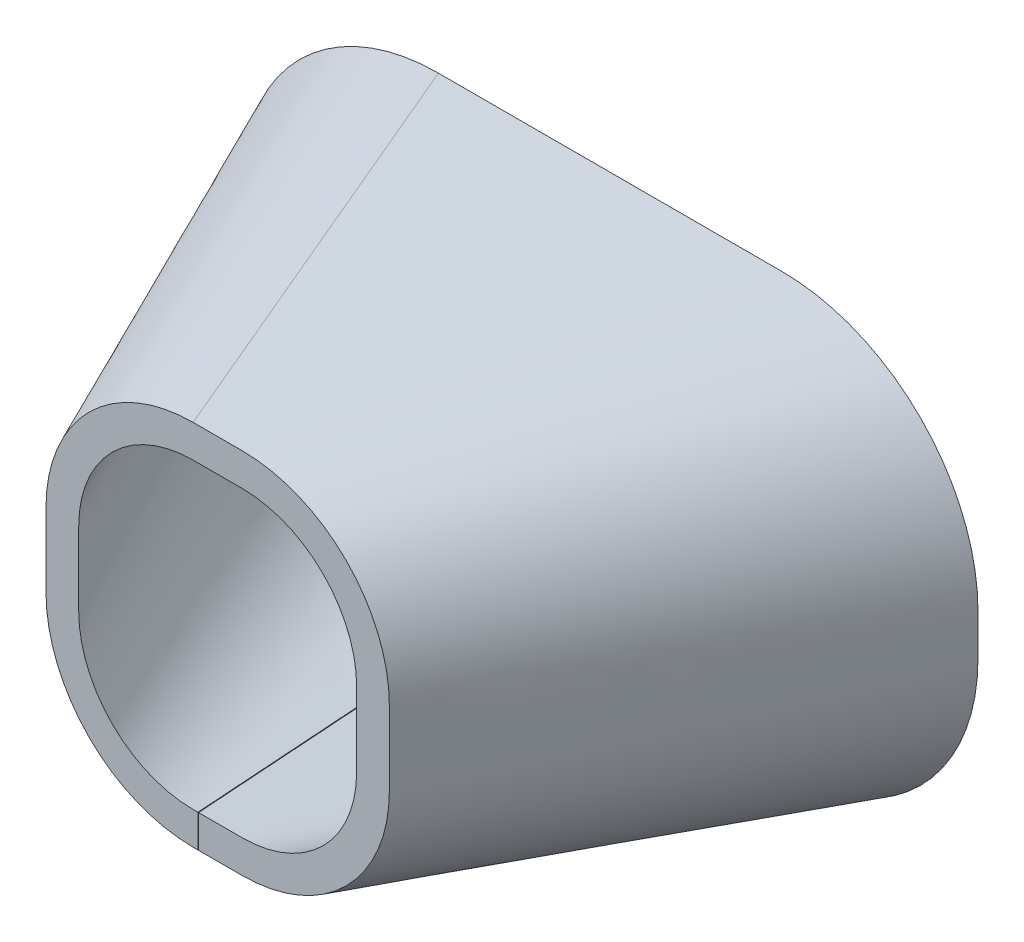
ISO-10303-21;
HEADER;
FILE_DESCRIPTION(('STEP AP214'),'2;1');
FILE_NAME('part.step','',(''),(''),'','','');
FILE_SCHEMA(('AUTOMOTIVE_DESIGN { 1 0 10303 214 1 1 1 1 }'));
ENDSEC;
DATA;
#1=APPLICATION_CONTEXT('core data for automotive mechanical design processes');
#2=APPLICATION_PROTOCOL_DEFINITION('international standard','automotive_design',2000,#1);
#3=PRODUCT_CONTEXT('',#1,'mechanical');
#4=PRODUCT('Part','Part','',(#3));
#5=PRODUCT_RELATED_PRODUCT_CATEGORY('part','',(#4));
#6=PRODUCT_DEFINITION_FORMATION('','',#4);
#7=PRODUCT_DEFINITION_CONTEXT('part definition',#1,'design');
#8=PRODUCT_DEFINITION('design','',#6,#7);
#9=PRODUCT_DEFINITION_SHAPE('','',#8);
#10=(LENGTH_UNIT() NAMED_UNIT(*) SI_UNIT(.MILLI.,.METRE.));
#11=(NAMED_UNIT(*) PLANE_ANGLE_UNIT() SI_UNIT($,.RADIAN.));
#12=(NAMED_UNIT(*) SI_UNIT($,.STERADIAN.) SOLID_ANGLE_UNIT());
#13=UNCERTAINTY_MEASURE_WITH_UNIT(LENGTH_MEASURE(1.E-05),#10,'distance_accuracy_value','');
#14=(GEOMETRIC_REPRESENTATION_CONTEXT(3) GLOBAL_UNCERTAINTY_ASSIGNED_CONTEXT((#13)) GLOBAL_UNIT_ASSIGNED_CONTEXT((#10,
#11,#12)) REPRESENTATION_CONTEXT('',''));
#15=CARTESIAN_POINT('',(0.,0.,0.));
#16=DIRECTION('',(0.,0.,1.));
#17=DIRECTION('',(1.,0.,0.));
#18=AXIS2_PLACEMENT_3D('',#15,#16,#17);
#19=CARTESIAN_POINT('',(240.,155.,240.));
#20=DIRECTION('',(0.,0.,-1.));
#21=DIRECTION('',(-1.,0.,0.));
#22=AXIS2_PLACEMENT_3D('',#19,#20,#21);
#23=PLANE('',#22);
#24=CARTESIAN_POINT('',(240.,155.,240.));
#25=DIRECTION('',(0.,0.,1.));
#26=DIRECTION('',(-1.,0.,0.));
#27=AXIS2_PLACEMENT_3D('',#24,#25,#26);
#28=CIRCLE('',#27,90.);
#29=CARTESIAN_POINT('',(330.,154.999999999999,240.));
#30=VERTEX_POINT('',#29);
#31=CARTESIAN_POINT('',(239.999999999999,245.,240.));
#32=VERTEX_POINT('',#31);
#33=EDGE_CURVE('E582',#30,#32,#28,.T.);
#34=ORIENTED_EDGE('',*,*,#33,.T.);
#35=DIRECTION('',(-1.,0.,0.));
#36=VECTOR('',#35,1.);
#37=CARTESIAN_POINT('',(210.000000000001,245.,240.));
#38=LINE('',#37,#36);
#39=CARTESIAN_POINT('',(210.000000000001,245.,240.));
#40=VERTEX_POINT('',#39);
#41=EDGE_CURVE('E591',#32,#40,#38,.T.);
#42=ORIENTED_EDGE('',*,*,#41,.T.);
#43=CARTESIAN_POINT('',(210.,155.,240.));
#44=DIRECTION('',(0.,0.,1.));
#45=DIRECTION('',(-1.,0.,0.));
#46=AXIS2_PLACEMENT_3D('',#43,#44,#45);
#47=CIRCLE('',#46,90.);
#48=CARTESIAN_POINT('',(120.,154.999999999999,240.));
#49=VERTEX_POINT('',#48);
#50=EDGE_CURVE('E801',#40,#49,#47,.T.);
#51=ORIENTED_EDGE('',*,*,#50,.T.);
#52=DIRECTION('',(0.,-1.,0.));
#53=VECTOR('',#52,1.);
#54=CARTESIAN_POINT('',(120.,110.000000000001,240.));
#55=LINE('',#54,#53);
#56=CARTESIAN_POINT('',(120.,110.000000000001,240.));
#57=VERTEX_POINT('',#56);
#58=EDGE_CURVE('E793',#49,#57,#55,.T.);
#59=ORIENTED_EDGE('',*,*,#58,.T.);
#60=CARTESIAN_POINT('',(210.,110.,240.));
#61=DIRECTION('',(0.,0.,1.));
#62=DIRECTION('',(-1.,0.,0.));
#63=AXIS2_PLACEMENT_3D('',#60,#61,#62);
#64=CIRCLE('',#63,90.);
#65=CARTESIAN_POINT('',(210.000000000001,20.,240.));
#66=VERTEX_POINT('',#65);
#67=EDGE_CURVE('E785',#57,#66,#64,.T.);
#68=ORIENTED_EDGE('',*,*,#67,.T.);
#69=DIRECTION('',(1.,0.,0.));
#70=VECTOR('',#69,1.);
#71=CARTESIAN_POINT('',(210.000000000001,20.,240.));
#72=LINE('',#71,#70);
#73=CARTESIAN_POINT('',(212.907629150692,20.,240.));
#74=VERTEX_POINT('',#73);
#75=EDGE_CURVE('E777',#66,#74,#72,.T.);
#76=ORIENTED_EDGE('',*,*,#75,.T.);
#77=DIRECTION('',(0.,1.,0.));
#78=VECTOR('',#77,1.);
#79=CARTESIAN_POINT('',(212.907629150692,40.,240.));
#80=LINE('',#79,#78);
#81=CARTESIAN_POINT('',(212.907629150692,40.,240.));
#82=VERTEX_POINT('',#81);
#83=EDGE_CURVE('E769',#74,#82,#80,.T.);
#84=ORIENTED_EDGE('',*,*,#83,.T.);
#85=DIRECTION('',(-1.,0.,0.));
#86=VECTOR('',#85,1.);
#87=CARTESIAN_POINT('',(210.000000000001,40.,240.));
#88=LINE('',#87,#86);
#89=CARTESIAN_POINT('',(210.000000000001,40.,240.));
#90=VERTEX_POINT('',#89);
#91=EDGE_CURVE('E761',#82,#90,#88,.T.);
#92=ORIENTED_EDGE('',*,*,#91,.T.);
#93=CARTESIAN_POINT('',(210.,110.,240.));
#94=DIRECTION('',(0.,0.,-1.));
#95=DIRECTION('',(-1.,0.,0.));
#96=AXIS2_PLACEMENT_3D('',#93,#94,#95);
#97=CIRCLE('',#96,70.);
#98=CARTESIAN_POINT('',(140.,110.000000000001,240.));
#99=VERTEX_POINT('',#98);
#100=EDGE_CURVE('E753',#90,#99,#97,.T.);
#101=ORIENTED_EDGE('',*,*,#100,.T.);
#102=DIRECTION('',(0.,1.,0.));
#103=VECTOR('',#102,1.);
#104=CARTESIAN_POINT('',(140.,110.,240.));
#105=LINE('',#104,#103);
#106=CARTESIAN_POINT('',(140.,155.,240.));
#107=VERTEX_POINT('',#106);
#108=EDGE_CURVE('E745',#99,#107,#105,.T.);
#109=ORIENTED_EDGE('',*,*,#108,.T.);
#110=CARTESIAN_POINT('',(210.,155.,240.));
#111=DIRECTION('',(0.,0.,-1.));
#112=DIRECTION('',(-1.,0.,0.));
#113=AXIS2_PLACEMENT_3D('',#110,#111,#112);
#114=CIRCLE('',#113,70.);
#115=CARTESIAN_POINT('',(210.000000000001,225.,240.));
#116=VERTEX_POINT('',#115);
#117=EDGE_CURVE('E737',#107,#116,#114,.T.);
#118=ORIENTED_EDGE('',*,*,#117,.T.);
#119=DIRECTION('',(1.,0.,0.));
#120=VECTOR('',#119,1.);
#121=CARTESIAN_POINT('',(210.,225.,240.));
#122=LINE('',#121,#120);
#123=CARTESIAN_POINT('',(239.999999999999,225.,240.));
#124=VERTEX_POINT('',#123);
#125=EDGE_CURVE('E729',#116,#124,#122,.T.);
#126=ORIENTED_EDGE('',*,*,#125,.T.);
#127=CARTESIAN_POINT('',(240.,155.,240.));
#128=DIRECTION('',(0.,0.,-1.));
#129=DIRECTION('',(-1.,0.,0.));
#130=AXIS2_PLACEMENT_3D('',#127,#128,#129);
#131=CIRCLE('',#130,70.);
#132=CARTESIAN_POINT('',(310.,155.,240.));
#133=VERTEX_POINT('',#132);
#134=EDGE_CURVE('E721',#124,#133,#131,.T.);
#135=ORIENTED_EDGE('',*,*,#134,.T.);
#136=DIRECTION('',(0.,-1.,0.));
#137=VECTOR('',#136,1.);
#138=CARTESIAN_POINT('',(310.,110.000000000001,240.));
#139=LINE('',#138,#137);
#140=CARTESIAN_POINT('',(310.,110.000000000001,240.));
#141=VERTEX_POINT('',#140);
#142=EDGE_CURVE('E713',#133,#141,#139,.T.);
#143=ORIENTED_EDGE('',*,*,#142,.T.);
#144=CARTESIAN_POINT('',(240.,110.,240.));
#145=DIRECTION('',(0.,0.,-1.));
#146=DIRECTION('',(-1.,0.,0.));
#147=AXIS2_PLACEMENT_3D('',#144,#145,#146);
#148=CIRCLE('',#147,70.);
#149=CARTESIAN_POINT('',(240.,40.,240.));
#150=VERTEX_POINT('',#149);
#151=EDGE_CURVE('E705',#141,#150,#148,.T.);
#152=ORIENTED_EDGE('',*,*,#151,.T.);
#153=DIRECTION('',(-1.,0.,0.));
#154=VECTOR('',#153,1.);
#155=CARTESIAN_POINT('',(213.307629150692,40.,240.));
#156=LINE('',#155,#154);
#157=CARTESIAN_POINT('',(213.307629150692,40.,240.));
#158=VERTEX_POINT('',#157);
#159=EDGE_CURVE('E697',#150,#158,#156,.T.);
#160=ORIENTED_EDGE('',*,*,#159,.T.);
#161=DIRECTION('',(0.,-1.,0.));
#162=VECTOR('',#161,1.);
#163=CARTESIAN_POINT('',(213.307629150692,40.,240.));
#164=LINE('',#163,#162);
#165=CARTESIAN_POINT('',(213.307629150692,20.,240.));
#166=VERTEX_POINT('',#165);
#167=EDGE_CURVE('E678',#158,#166,#164,.T.);
#168=ORIENTED_EDGE('',*,*,#167,.T.);
#169=DIRECTION('',(1.,0.,0.));
#170=VECTOR('',#169,1.);
#171=CARTESIAN_POINT('',(213.307629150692,20.,240.));
#172=LINE('',#171,#170);
#173=CARTESIAN_POINT('',(239.999999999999,20.,240.));
#174=VERTEX_POINT('',#173);
#175=EDGE_CURVE('E676',#166,#174,#172,.T.);
#176=ORIENTED_EDGE('',*,*,#175,.T.);
#177=CARTESIAN_POINT('',(240.,110.,240.));
#178=DIRECTION('',(0.,0.,1.));
#179=DIRECTION('',(-1.,0.,0.));
#180=AXIS2_PLACEMENT_3D('',#177,#178,#179);
#181=CIRCLE('',#180,90.);
#182=CARTESIAN_POINT('',(330.,110.000000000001,240.));
#183=VERTEX_POINT('',#182);
#184=EDGE_CURVE('E575',#174,#183,#181,.T.);
#185=ORIENTED_EDGE('',*,*,#184,.T.);
#186=DIRECTION('',(0.,1.,0.));
#187=VECTOR('',#186,1.);
#188=CARTESIAN_POINT('',(330.,110.000000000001,240.));
#189=LINE('',#188,#187);
#190=EDGE_CURVE('E579',#183,#30,#189,.T.);
#191=ORIENTED_EDGE('',*,*,#190,.T.);
#192=EDGE_LOOP('',(#34,#42,#51,#59,#68,#76,#84,#92,#101,#109,#118,#126,#135,#143,#152,#160,#168,
#176,#185,#191));
#193=FACE_BOUND('',#192,.T.);
#194=ADVANCED_FACE('F439',(#193),#23,.F.);
#195=CARTESIAN_POINT('',(330.,145.,0.));
#196=DIRECTION('',(0.,0.,-1.));
#197=DIRECTION('',(-1.,0.,0.));
#198=AXIS2_PLACEMENT_3D('',#195,#196,#197);
#199=PLANE('',#198);
#200=CARTESIAN_POINT('',(330.,145.,0.));
#201=DIRECTION('',(0.,0.,1.));
#202=DIRECTION('',(-1.,0.,0.));
#203=AXIS2_PLACEMENT_3D('',#200,#201,#202);
#204=CIRCLE('',#203,120.);
#205=CARTESIAN_POINT('',(450.,144.999999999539,0.));
#206=VERTEX_POINT('',#205);
#207=CARTESIAN_POINT('',(330.,265.,0.));
#208=VERTEX_POINT('',#207);
#209=EDGE_CURVE('E836',#206,#208,#204,.T.);
#210=ORIENTED_EDGE('',*,*,#209,.F.);
#211=DIRECTION('',(0.,1.,0.));
#212=VECTOR('',#211,1.);
#213=CARTESIAN_POINT('',(450.,120.,0.));
#214=LINE('',#213,#212);
#215=CARTESIAN_POINT('',(450.,120.00000000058,0.));
#216=VERTEX_POINT('',#215);
#217=EDGE_CURVE('E1051',#216,#206,#214,.T.);
#218=ORIENTED_EDGE('',*,*,#217,.F.);
#219=CARTESIAN_POINT('',(330.,120.,0.));
#220=DIRECTION('',(0.,0.,1.));
#221=DIRECTION('',(-1.,0.,0.));
#222=AXIS2_PLACEMENT_3D('',#219,#220,#221);
#223=CIRCLE('',#222,120.);
#224=CARTESIAN_POINT('',(330.00000000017,0.,0.));
#225=VERTEX_POINT('',#224);
#226=EDGE_CURVE('E1044',#225,#216,#223,.T.);
#227=ORIENTED_EDGE('',*,*,#226,.F.);
#228=DIRECTION('',(1.,0.,0.));
#229=VECTOR('',#228,1.);
#230=CARTESIAN_POINT('',(178.594935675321,0.,0.));
#231=LINE('',#230,#229);
#232=CARTESIAN_POINT('',(178.594935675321,0.,0.));
#233=VERTEX_POINT('',#232);
#234=EDGE_CURVE('E1042',#233,#225,#231,.T.);
#235=ORIENTED_EDGE('',*,*,#234,.F.);
#236=DIRECTION('',(0.,-1.,0.));
#237=VECTOR('',#236,1.);
#238=CARTESIAN_POINT('',(178.594935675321,20.,0.));
#239=LINE('',#238,#237);
#240=CARTESIAN_POINT('',(178.594935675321,20.,0.));
#241=VERTEX_POINT('',#240);
#242=EDGE_CURVE('E1048',#241,#233,#239,.T.);
#243=ORIENTED_EDGE('',*,*,#242,.F.);
#244=DIRECTION('',(-1.,0.,0.));
#245=VECTOR('',#244,1.);
#246=CARTESIAN_POINT('',(178.594935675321,20.,0.));
#247=LINE('',#246,#245);
#248=CARTESIAN_POINT('',(330.000000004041,20.,0.));
#249=VERTEX_POINT('',#248);
#250=EDGE_CURVE('E1193',#249,#241,#247,.T.);
#251=ORIENTED_EDGE('',*,*,#250,.F.);
#252=CARTESIAN_POINT('',(330.,120.,0.));
#253=DIRECTION('',(0.,0.,-1.));
#254=DIRECTION('',(-1.,0.,0.));
#255=AXIS2_PLACEMENT_3D('',#252,#253,#254);
#256=CIRCLE('',#255,100.);
#257=CARTESIAN_POINT('',(430.,119.999999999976,0.));
#258=VERTEX_POINT('',#257);
#259=EDGE_CURVE('E1184',#258,#249,#256,.T.);
#260=ORIENTED_EDGE('',*,*,#259,.F.);
#261=DIRECTION('',(0.,-1.,0.));
#262=VECTOR('',#261,1.);
#263=CARTESIAN_POINT('',(430.,120.,0.));
#264=LINE('',#263,#262);
#265=CARTESIAN_POINT('',(430.,144.999999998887,0.));
#266=VERTEX_POINT('',#265);
#267=EDGE_CURVE('E1175',#266,#258,#264,.T.);
#268=ORIENTED_EDGE('',*,*,#267,.F.);
#269=CARTESIAN_POINT('',(330.,145.,0.));
#270=DIRECTION('',(0.,0.,-1.));
#271=DIRECTION('',(-1.,0.,0.));
#272=AXIS2_PLACEMENT_3D('',#269,#270,#271);
#273=CIRCLE('',#272,100.);
#274=CARTESIAN_POINT('',(330.,245.,0.));
#275=VERTEX_POINT('',#274);
#276=EDGE_CURVE('E1166',#275,#266,#273,.T.);
#277=ORIENTED_EDGE('',*,*,#276,.F.);
#278=DIRECTION('',(1.,0.,0.));
#279=VECTOR('',#278,1.);
#280=CARTESIAN_POINT('',(120.,245.,0.));
#281=LINE('',#280,#279);
#282=CARTESIAN_POINT('',(120.000000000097,245.,0.));
#283=VERTEX_POINT('',#282);
#284=EDGE_CURVE('E1157',#283,#275,#281,.T.);
#285=ORIENTED_EDGE('',*,*,#284,.F.);
#286=CARTESIAN_POINT('',(120.,145.,0.));
#287=DIRECTION('',(0.,0.,-1.));
#288=DIRECTION('',(-1.,0.,0.));
#289=AXIS2_PLACEMENT_3D('',#286,#287,#288);
#290=CIRCLE('',#289,100.);
#291=CARTESIAN_POINT('',(20.,145.000000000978,0.));
#292=VERTEX_POINT('',#291);
#293=EDGE_CURVE('E1148',#292,#283,#290,.T.);
#294=ORIENTED_EDGE('',*,*,#293,.F.);
#295=DIRECTION('',(0.,1.,0.));
#296=VECTOR('',#295,1.);
#297=CARTESIAN_POINT('',(20.,120.,0.));
#298=LINE('',#297,#296);
#299=CARTESIAN_POINT('',(20.,120.000000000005,0.));
#300=VERTEX_POINT('',#299);
#301=EDGE_CURVE('E1139',#300,#292,#298,.T.);
#302=ORIENTED_EDGE('',*,*,#301,.F.);
#303=CARTESIAN_POINT('',(120.,120.,0.));
#304=DIRECTION('',(0.,0.,-1.));
#305=DIRECTION('',(-1.,0.,0.));
#306=AXIS2_PLACEMENT_3D('',#303,#304,#305);
#307=CIRCLE('',#306,100.);
#308=CARTESIAN_POINT('',(119.999999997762,20.,0.));
#309=VERTEX_POINT('',#308);
#310=EDGE_CURVE('E1130',#309,#300,#307,.T.);
#311=ORIENTED_EDGE('',*,*,#310,.F.);
#312=DIRECTION('',(-1.,0.,0.));
#313=VECTOR('',#312,1.);
#314=CARTESIAN_POINT('',(120.,20.,0.));
#315=LINE('',#314,#313);
#316=CARTESIAN_POINT('',(178.194935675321,20.,0.));
#317=VERTEX_POINT('',#316);
#318=EDGE_CURVE('E1121',#317,#309,#315,.T.);
#319=ORIENTED_EDGE('',*,*,#318,.F.);
#320=DIRECTION('',(0.,1.,0.));
#321=VECTOR('',#320,1.);
#322=CARTESIAN_POINT('',(178.194935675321,20.,0.));
#323=LINE('',#322,#321);
#324=CARTESIAN_POINT('',(178.194935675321,0.,0.));
#325=VERTEX_POINT('',#324);
#326=EDGE_CURVE('E1112',#325,#317,#323,.T.);
#327=ORIENTED_EDGE('',*,*,#326,.F.);
#328=DIRECTION('',(1.,0.,0.));
#329=VECTOR('',#328,1.);
#330=CARTESIAN_POINT('',(120.,0.,0.));
#331=LINE('',#330,#329);
#332=CARTESIAN_POINT('',(119.999999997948,0.,0.));
#333=VERTEX_POINT('',#332);
#334=EDGE_CURVE('E1103',#333,#325,#331,.T.);
#335=ORIENTED_EDGE('',*,*,#334,.F.);
#336=CARTESIAN_POINT('',(120.,120.,0.));
#337=DIRECTION('',(0.,0.,1.));
#338=DIRECTION('',(-1.,0.,0.));
#339=AXIS2_PLACEMENT_3D('',#336,#337,#338);
#340=CIRCLE('',#339,120.);
#341=CARTESIAN_POINT('',(0.,120.,0.));
#342=VERTEX_POINT('',#341);
#343=EDGE_CURVE('E1094',#342,#333,#340,.T.);
#344=ORIENTED_EDGE('',*,*,#343,.F.);
#345=DIRECTION('',(0.,-1.,0.));
#346=VECTOR('',#345,1.);
#347=CARTESIAN_POINT('',(0.,120.,0.));
#348=LINE('',#347,#346);
#349=CARTESIAN_POINT('',(0.,145.000000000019,0.));
#350=VERTEX_POINT('',#349);
#351=EDGE_CURVE('E1087',#350,#342,#348,.T.);
#352=ORIENTED_EDGE('',*,*,#351,.F.);
#353=CARTESIAN_POINT('',(120.,145.,0.));
#354=DIRECTION('',(0.,0.,1.));
#355=DIRECTION('',(-1.,0.,0.));
#356=AXIS2_PLACEMENT_3D('',#353,#354,#355);
#357=CIRCLE('',#356,120.);
#358=CARTESIAN_POINT('',(120.,265.,0.));
#359=VERTEX_POINT('',#358);
#360=EDGE_CURVE('E450',#359,#350,#357,.T.);
#361=ORIENTED_EDGE('',*,*,#360,.F.);
#362=DIRECTION('',(-1.,0.,0.));
#363=VECTOR('',#362,1.);
#364=CARTESIAN_POINT('',(120.,265.,0.));
#365=LINE('',#364,#363);
#366=EDGE_CURVE('E12',#208,#359,#365,.T.);
#367=ORIENTED_EDGE('',*,*,#366,.F.);
#368=EDGE_LOOP('',(#210,#218,#227,#235,#243,#251,#260,#268,#277,#285,#294,#302,#311,#319,#327,
#335,#344,#352,#361,#367));
#369=FACE_BOUND('',#368,.T.);
#370=ADVANCED_FACE('F859',(#369),#199,.T.);
#371=CARTESIAN_POINT('',(120.,265.,0.));
#372=CARTESIAN_POINT('',(210.000000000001,245.,240.));
#373=CARTESIAN_POINT('',(111.022292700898,265.,0.));
#374=CARTESIAN_POINT('',(204.749301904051,245.,240.));
#375=CARTESIAN_POINT('',(93.5347151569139,262.986011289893,0.));
#376=CARTESIAN_POINT('',(194.054159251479,244.078906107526,240.));
#377=CARTESIAN_POINT('',(75.5789624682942,256.872421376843,0.));
#378=CARTESIAN_POINT('',(181.99180910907,240.775328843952,240.));
#379=CARTESIAN_POINT('',(64.5269948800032,251.467077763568,0.));
#380=CARTESIAN_POINT('',(174.140932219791,237.584153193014,240.));
#381=CARTESIAN_POINT('',(59.1916667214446,248.511575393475,0.));
#382=CARTESIAN_POINT('',(170.265023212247,235.79117018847,240.));
#383=CARTESIAN_POINT('',(54.0557805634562,245.316742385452,0.));
#384=CARTESIAN_POINT('',(166.45003510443,233.801154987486,240.));
#385=CARTESIAN_POINT('',(47.4822765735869,240.755107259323,0.));
#386=CARTESIAN_POINT('',(161.459800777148,230.885575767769,240.));
#387=CARTESIAN_POINT('',(39.797380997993,234.519981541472,0.));
#388=CARTESIAN_POINT('',(155.431267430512,226.750336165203,240.));
#389=CARTESIAN_POINT('',(31.4704077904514,226.287103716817,0.));
#390=CARTESIAN_POINT('',(148.626796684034,221.031228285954,240.));
#391=CARTESIAN_POINT('',(24.0753942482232,217.404337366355,0.));
#392=CARTESIAN_POINT('',(142.347049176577,214.583704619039,240.));
#393=CARTESIAN_POINT('',(15.4928414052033,204.8243877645,0.));
#394=CARTESIAN_POINT('',(134.793858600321,205.091330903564,240.));
#395=CARTESIAN_POINT('',(7.21746135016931,187.96151869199,0.));
#396=CARTESIAN_POINT('',(127.114835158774,191.68812012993,240.));
#397=CARTESIAN_POINT('',(1.29250354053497,166.646492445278,0.));
#398=CARTESIAN_POINT('',(121.318260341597,173.815023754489,240.));
#399=CARTESIAN_POINT('',(0.,152.184443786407,0.));
#400=CARTESIAN_POINT('',(120.,161.271684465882,240.));
#401=CARTESIAN_POINT('',(0.,141.577591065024,0.));
#402=CARTESIAN_POINT('',(120.,152.012396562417,240.));
#403=CARTESIAN_POINT('',(0.,137.88569806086,0.));
#404=CARTESIAN_POINT('',(120.,145.330588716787,240.));
#405=CARTESIAN_POINT('',(0.,132.5,0.));
#406=CARTESIAN_POINT('',(120.,132.5,240.));
#407=CARTESIAN_POINT('',(0.,127.11430193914,0.));
#408=CARTESIAN_POINT('',(120.,119.669411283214,240.));
#409=CARTESIAN_POINT('',(0.,123.422408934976,0.));
#410=CARTESIAN_POINT('',(120.,112.987603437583,240.));
#411=CARTESIAN_POINT('',(0.,112.815556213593,0.));
#412=CARTESIAN_POINT('',(120.,103.728315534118,240.));
#413=CARTESIAN_POINT('',(1.292503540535,98.3535075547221,0.));
#414=CARTESIAN_POINT('',(121.318260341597,91.1849762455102,240.));
#415=CARTESIAN_POINT('',(7.21746135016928,77.0384813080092,0.));
#416=CARTESIAN_POINT('',(127.114835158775,73.3118798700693,240.));
#417=CARTESIAN_POINT('',(15.4928414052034,60.1756122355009,0.));
#418=CARTESIAN_POINT('',(134.793858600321,59.9086690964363,240.));
#419=CARTESIAN_POINT('',(24.0753942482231,47.5956626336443,0.));
#420=CARTESIAN_POINT('',(142.347049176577,50.416295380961,240.));
#421=CARTESIAN_POINT('',(31.4704077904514,38.7128962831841,0.));
#422=CARTESIAN_POINT('',(148.626796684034,43.9687717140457,240.));
#423=CARTESIAN_POINT('',(39.7973809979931,30.4800184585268,0.));
#424=CARTESIAN_POINT('',(155.431267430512,38.2496638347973,240.));
#425=CARTESIAN_POINT('',(47.4822765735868,24.2448927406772,0.));
#426=CARTESIAN_POINT('',(161.459800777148,34.1144242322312,240.));
#427=CARTESIAN_POINT('',(54.0557805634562,19.6832576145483,0.));
#428=CARTESIAN_POINT('',(166.450035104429,31.1988450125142,240.));
#429=CARTESIAN_POINT('',(59.1916667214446,16.4884246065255,0.));
#430=CARTESIAN_POINT('',(170.265023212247,29.2088298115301,240.));
#431=CARTESIAN_POINT('',(64.5269948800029,13.5329222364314,0.));
#432=CARTESIAN_POINT('',(174.140932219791,27.4158468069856,240.));
#433=CARTESIAN_POINT('',(75.5789624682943,8.12757862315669,0.));
#434=CARTESIAN_POINT('',(181.99180910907,24.2246711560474,240.));
#435=CARTESIAN_POINT('',(93.5347151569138,2.01398871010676,0.));
#436=CARTESIAN_POINT('',(194.054159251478,20.921093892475,240.));
#437=CARTESIAN_POINT('',(111.022292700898,0.,0.));
#438=CARTESIAN_POINT('',(204.749301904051,20.,240.));
#439=CARTESIAN_POINT('',(120.325265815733,0.,0.));
#440=CARTESIAN_POINT('',(210.190234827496,20.,240.));
#441=CARTESIAN_POINT('',(121.014821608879,0.,0.));
#442=CARTESIAN_POINT('',(210.224054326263,20.,240.));
#443=CARTESIAN_POINT('',(122.54937412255,0.,0.));
#444=CARTESIAN_POINT('',(210.458872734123,20.,240.));
#445=CARTESIAN_POINT('',(124.757787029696,0.,0.));
#446=CARTESIAN_POINT('',(210.591444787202,20.,240.));
#447=CARTESIAN_POINT('',(127.868303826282,0.,0.));
#448=CARTESIAN_POINT('',(210.777448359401,20.,240.));
#449=CARTESIAN_POINT('',(132.624308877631,0.,0.));
#450=CARTESIAN_POINT('',(210.969651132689,20.,240.));
#451=CARTESIAN_POINT('',(139.700696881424,0.,0.));
#452=CARTESIAN_POINT('',(211.199495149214,20.,240.));
#453=CARTESIAN_POINT('',(149.09746783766,0.,0.));
#454=CARTESIAN_POINT('',(211.453814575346,20.,239.999999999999));
#455=CARTESIAN_POINT('',(158.494238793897,0.,0.));
#456=CARTESIAN_POINT('',(211.708134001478,20.,240.000000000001));
#457=CARTESIAN_POINT('',(165.570626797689,0.,0.));
#458=CARTESIAN_POINT('',(211.937978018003,20.,239.999999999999));
#459=CARTESIAN_POINT('',(170.326631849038,0.,0.));
#460=CARTESIAN_POINT('',(212.130180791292,20.,240.));
#461=CARTESIAN_POINT('',(173.437148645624,0.,0.));
#462=CARTESIAN_POINT('',(212.31618436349,20.,240.));
#463=CARTESIAN_POINT('',(175.645561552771,0.,0.));
#464=CARTESIAN_POINT('',(212.448756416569,20.,240.));
#465=CARTESIAN_POINT('',(177.180114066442,0.,0.));
#466=CARTESIAN_POINT('',(212.68357482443,20.,240.));
#467=CARTESIAN_POINT('',(177.869669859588,0.,0.));
#468=CARTESIAN_POINT('',(212.717394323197,20.,240.));
#469=CARTESIAN_POINT('',(178.194935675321,0.,0.));
#470=CARTESIAN_POINT('',(212.907629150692,20.,240.));
#471=B_SPLINE_SURFACE_WITH_KNOTS('',3,1,((#371,#372),(#373,#374),(#375,#376),(#377,#378),(#379,
#380),(#381,#382),(#383,#384),(#385,#386),(#387,#388),(#389,#390),(#391,#392),(#393,#394),(#395,
#396),(#397,#398),(#399,#400),(#401,#402),(#403,#404),(#405,#406),(#407,#408),(#409,#410),(#411,
#412),(#413,#414),(#415,#416),(#417,#418),(#419,#420),(#421,#422),(#423,#424),(#425,#426),(#427,
#428),(#429,#430),(#431,#432),(#433,#434),(#435,#436),(#437,#438),(#439,#440),(#441,#442),(#443,
#444),(#445,#446),(#447,#448),(#449,#450),(#451,#452),(#453,#454),(#455,#456),(#457,#458),(#459,
#460),(#461,#462),(#463,#464),(#465,#466),(#467,#468),(#469,#470)),.UNSPECIFIED.,.F.,.F.,.F.,(4,
1,1,1,1,1,1,1,1,1,1,1,1,2,1,1,1,2,1,1,1,1,1,1,1,1,1,1,1,1,2,1,1,1,1,1,1,1,1,1,1,1,1,1,4),(2,2),
(0.,0.05245261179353,0.10490522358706,0.118018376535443,0.131131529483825,0.144244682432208,
0.15735783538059,0.183584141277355,0.20981044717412,0.236036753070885,0.26226305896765,
0.31471567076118,0.36716828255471,0.41962089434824,0.444607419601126,0.469593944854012,
0.494580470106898,0.519566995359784,0.572019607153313,0.624472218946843,0.676924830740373,
0.703151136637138,0.729377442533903,0.755603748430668,0.781830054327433,0.794943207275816,
0.808056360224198,0.821169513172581,0.834282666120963,0.886735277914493,0.939187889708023,
0.941088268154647,0.942988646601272,0.946789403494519,0.950590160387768,0.954390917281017,
0.961992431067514,0.969593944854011,0.977195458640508,0.984796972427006,0.988597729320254,
0.992398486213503,0.996199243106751,0.998099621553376,1.),(0.,1.),.UNSPECIFIED.);
#472=DIRECTION('',(0.142662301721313,0.0821960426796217,0.98635251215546));
#473=VECTOR('',#472,1.);
#474=CARTESIAN_POINT('',(195.551282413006,10.,120.));
#475=LINE('',#474,#473);
#476=EDGE_CURVE('E833',#325,#74,#475,.T.);
#477=DIRECTION('',(-0.350059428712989,0.0777909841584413,-0.933491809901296));
#478=VECTOR('',#477,1.);
#479=CARTESIAN_POINT('',(165.,255.,120.));
#480=LINE('',#479,#478);
#481=EDGE_CURVE('E829',#40,#359,#480,.T.);
#482=ORIENTED_EDGE('',*,*,#360,.T.);
#483=ORIENTED_EDGE('',*,*,#351,.T.);
#484=ORIENTED_EDGE('',*,*,#343,.T.);
#485=ORIENTED_EDGE('',*,*,#334,.T.);
#486=ORIENTED_EDGE('',*,*,#476,.T.);
#487=ORIENTED_EDGE('',*,*,#75,.F.);
#488=ORIENTED_EDGE('',*,*,#67,.F.);
#489=ORIENTED_EDGE('',*,*,#58,.F.);
#490=ORIENTED_EDGE('',*,*,#50,.F.);
#491=ORIENTED_EDGE('',*,*,#481,.T.);
#492=EDGE_LOOP('',(#482,#483,#484,#485,#486,#487,#488,#489,#490,#491));
#493=FACE_BOUND('',#492,.T.);
#494=ADVANCED_FACE('F828',(#493),#471,.T.);
#495=CARTESIAN_POINT('',(178.194935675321,0.,0.));
#496=DIRECTION('',(0.989701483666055,0.,-0.143146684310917));
#497=DIRECTION('',(0.,1.,0.));
#498=AXIS2_PLACEMENT_3D('',#495,#496,#497);
#499=PLANE('',#498);
#500=ORIENTED_EDGE('',*,*,#326,.T.);
#501=DIRECTION('',(0.142662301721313,0.0821960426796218,0.98635251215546));
#502=VECTOR('',#501,1.);
#503=CARTESIAN_POINT('',(195.551282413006,30.,120.));
#504=LINE('',#503,#502);
#505=EDGE_CURVE('E834',#317,#82,#504,.T.);
#506=ORIENTED_EDGE('',*,*,#505,.T.);
#507=ORIENTED_EDGE('',*,*,#83,.F.);
#508=ORIENTED_EDGE('',*,*,#476,.F.);
#509=EDGE_LOOP('',(#500,#506,#507,#508));
#510=FACE_BOUND('',#509,.T.);
#511=ADVANCED_FACE('F616',(#510),#499,.T.);
#512=CARTESIAN_POINT('',(178.594935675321,0.,0.));
#513=CARTESIAN_POINT('',(213.307629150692,20.,240.));
#514=CARTESIAN_POINT('',(191.549618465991,0.,0.));
#515=CARTESIAN_POINT('',(215.339785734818,20.,240.));
#516=CARTESIAN_POINT('',(220.38084624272,0.,0.));
#517=CARTESIAN_POINT('',(219.251066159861,20.,240.));
#518=CARTESIAN_POINT('',(265.013471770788,0.,0.));
#519=CARTESIAN_POINT('',(224.669926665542,20.,240.));
#520=CARTESIAN_POINT('',(301.669848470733,0.,0.));
#521=CARTESIAN_POINT('',(231.255457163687,20.,240.));
#522=CARTESIAN_POINT('',(321.156343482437,0.,0.));
#523=CARTESIAN_POINT('',(235.627249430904,20.,240.));
#524=CARTESIAN_POINT('',(334.870348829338,0.,0.));
#525=CARTESIAN_POINT('',(242.408146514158,20.,240.));
#526=CARTESIAN_POINT('',(344.335610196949,0.590787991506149,0.));
#527=CARTESIAN_POINT('',(247.303069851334,20.1933170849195,240.));
#528=CARTESIAN_POINT('',(357.695259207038,2.98840240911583,0.));
#529=CARTESIAN_POINT('',(254.831697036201,21.1190615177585,240.));
#530=CARTESIAN_POINT('',(370.203238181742,6.69292440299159,0.));
#531=CARTESIAN_POINT('',(262.496917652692,22.7363923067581,240.));
#532=CARTESIAN_POINT('',(385.727327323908,13.1583595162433,0.));
#533=CARTESIAN_POINT('',(272.798757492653,25.87987079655,240.));
#534=CARTESIAN_POINT('',(402.936862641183,23.7382957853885,0.));
#535=CARTESIAN_POINT('',(285.640370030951,31.7816434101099,240.));
#536=CARTESIAN_POINT('',(419.979341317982,39.5206943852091,0.));
#537=CARTESIAN_POINT('',(300.171729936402,42.2423356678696,240.));
#538=CARTESIAN_POINT('',(433.331087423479,57.6532185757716,0.));
#539=CARTESIAN_POINT('',(312.832291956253,56.0032160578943,239.999999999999));
#540=CARTESIAN_POINT('',(442.925124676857,77.4932780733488,0.));
#541=CARTESIAN_POINT('',(322.604559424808,72.5650455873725,240.));
#542=CARTESIAN_POINT('',(448.709261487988,98.4577020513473,0.));
#543=CARTESIAN_POINT('',(328.677449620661,90.9995908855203,240.));
#544=CARTESIAN_POINT('',(450.,112.815556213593,0.));
#545=CARTESIAN_POINT('',(330.,103.728315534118,240.));
#546=CARTESIAN_POINT('',(450.,123.422408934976,0.));
#547=CARTESIAN_POINT('',(330.,112.987603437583,240.));
#548=CARTESIAN_POINT('',(450.,127.11430193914,0.));
#549=CARTESIAN_POINT('',(330.,119.669411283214,240.));
#550=CARTESIAN_POINT('',(450.,132.5,0.));
#551=CARTESIAN_POINT('',(330.,132.5,240.));
#552=CARTESIAN_POINT('',(450.,137.88569806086,0.));
#553=CARTESIAN_POINT('',(330.,145.330588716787,240.));
#554=CARTESIAN_POINT('',(450.,141.577591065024,0.));
#555=CARTESIAN_POINT('',(330.,152.012396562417,240.));
#556=CARTESIAN_POINT('',(450.,148.592221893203,0.));
#557=CARTESIAN_POINT('',(330.,158.13584223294,240.));
#558=CARTESIAN_POINT('',(449.677690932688,155.755489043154,0.));
#559=CARTESIAN_POINT('',(329.671401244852,164.496849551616,240.));
#560=CARTESIAN_POINT('',(448.241535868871,166.380831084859,0.));
#561=CARTESIAN_POINT('',(328.124565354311,174.142046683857,239.999999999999));
#562=CARTESIAN_POINT('',(445.866925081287,176.830585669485,0.));
#563=CARTESIAN_POINT('',(325.495310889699,183.696970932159,240.000000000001));
#564=CARTESIAN_POINT('',(442.563114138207,187.048339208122,0.));
#565=CARTESIAN_POINT('',(321.80534092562,192.962296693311,239.999999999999));
#566=CARTESIAN_POINT('',(438.339358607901,196.977678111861,0.));
#567=CARTESIAN_POINT('',(317.124901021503,201.735301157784,240.));
#568=CARTESIAN_POINT('',(431.487351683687,209.751315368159,0.));
#569=CARTESIAN_POINT('',(309.723117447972,212.564303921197,240.));
#570=CARTESIAN_POINT('',(420.645956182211,224.693843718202,0.));
#571=CARTESIAN_POINT('',(298.657260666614,224.099493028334,240.));
#572=CARTESIAN_POINT('',(406.765901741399,237.811403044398,0.));
#573=CARTESIAN_POINT('',(286.288998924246,232.552654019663,240.));
#574=CARTESIAN_POINT('',(393.804957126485,246.868583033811,0.));
#575=CARTESIAN_POINT('',(276.197248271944,237.538086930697,240.));
#576=CARTESIAN_POINT('',(383.136439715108,252.832828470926,0.));
#577=CARTESIAN_POINT('',(268.630291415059,240.447465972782,240.));
#578=CARTESIAN_POINT('',(371.49486370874,257.844466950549,0.));
#579=CARTESIAN_POINT('',(261.165617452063,242.586001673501,240.));
#580=CARTESIAN_POINT('',(358.840295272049,261.745799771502,0.));
#581=CARTESIAN_POINT('',(253.862996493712,244.024753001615,240.));
#582=CARTESIAN_POINT('',(345.112600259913,264.333444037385,0.));
#583=CARTESIAN_POINT('',(246.782198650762,244.834778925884,240.));
#584=CARTESIAN_POINT('',(335.184209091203,265.,0.));
#585=CARTESIAN_POINT('',(242.229451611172,245.,240.));
#586=CARTESIAN_POINT('',(317.528873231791,265.,0.));
#587=CARTESIAN_POINT('',(234.636834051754,245.,240.));
#588=CARTESIAN_POINT('',(289.996171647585,265.,0.));
#589=CARTESIAN_POINT('',(230.612196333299,245.,240.));
#590=CARTESIAN_POINT('',(237.827644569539,265.000000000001,0.));
#591=CARTESIAN_POINT('',(223.162390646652,245.,240.));
#592=CARTESIAN_POINT('',(175.599553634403,265.,0.));
#593=CARTESIAN_POINT('',(217.343492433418,245.,240.));
#594=CARTESIAN_POINT('',(137.162405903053,265.,0.));
#595=CARTESIAN_POINT('',(212.692207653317,245.,240.));
#596=CARTESIAN_POINT('',(120.,265.,0.));
#597=CARTESIAN_POINT('',(210.000000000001,245.,240.));
#598=B_SPLINE_SURFACE_WITH_KNOTS('',3,1,((#512,#513),(#514,#515),(#516,#517),(#518,#519),(#520,
#521),(#522,#523),(#524,#525),(#526,#527),(#528,#529),(#530,#531),(#532,#533),(#534,#535),(#536,
#537),(#538,#539),(#540,#541),(#542,#543),(#544,#545),(#546,#547),(#548,#549),(#550,#551),(#552,
#553),(#554,#555),(#556,#557),(#558,#559),(#560,#561),(#562,#563),(#564,#565),(#566,#567),(#568,
#569),(#570,#571),(#572,#573),(#574,#575),(#576,#577),(#578,#579),(#580,#581),(#582,#583),(#584,
#585),(#586,#587),(#588,#589),(#590,#591),(#592,#593),(#594,#595),(#596,#597)),.UNSPECIFIED.,
.F.,.F.,.F.,(4,1,1,1,2,1,1,1,1,1,1,1,1,1,2,1,1,1,2,1,1,1,1,1,1,1,1,1,1,1,1,1,2,1,1,1,4),(2,2),
(0.,0.034457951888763,0.068915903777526,0.103373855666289,0.137831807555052,0.156808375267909,
0.175784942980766,0.194761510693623,0.21373807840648,0.251691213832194,0.289644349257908,
0.327597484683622,0.365550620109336,0.40350375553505,0.441456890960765,0.45953639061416,
0.477615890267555,0.495695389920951,0.513774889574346,0.532751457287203,0.55172802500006,
0.570704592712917,0.589681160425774,0.608657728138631,0.627634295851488,0.665587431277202,
0.703540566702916,0.722517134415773,0.74149370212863,0.760470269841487,0.779446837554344,
0.798423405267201,0.817399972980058,0.863049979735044,0.908699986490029,0.954349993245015,1.),
(0.,1.),.UNSPECIFIED.);
#599=DIRECTION('',(0.142662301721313,0.0821960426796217,0.98635251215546));
#600=VECTOR('',#599,1.);
#601=CARTESIAN_POINT('',(195.951282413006,10.,120.));
#602=LINE('',#601,#600);
#603=EDGE_CURVE('E816',#233,#166,#602,.T.);
#604=ORIENTED_EDGE('',*,*,#234,.T.);
#605=ORIENTED_EDGE('',*,*,#226,.T.);
#606=ORIENTED_EDGE('',*,*,#217,.T.);
#607=ORIENTED_EDGE('',*,*,#209,.T.);
#608=ORIENTED_EDGE('',*,*,#366,.T.);
#609=ORIENTED_EDGE('',*,*,#481,.F.);
#610=ORIENTED_EDGE('',*,*,#41,.F.);
#611=ORIENTED_EDGE('',*,*,#33,.F.);
#612=ORIENTED_EDGE('',*,*,#190,.F.);
#613=ORIENTED_EDGE('',*,*,#184,.F.);
#614=ORIENTED_EDGE('',*,*,#175,.F.);
#615=ORIENTED_EDGE('',*,*,#603,.F.);
#616=EDGE_LOOP('',(#604,#605,#606,#607,#608,#609,#610,#611,#612,#613,#614,#615));
#617=FACE_BOUND('',#616,.T.);
#618=ADVANCED_FACE('F589',(#617),#598,.T.);
#619=CARTESIAN_POINT('',(178.194935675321,20.,0.));
#620=CARTESIAN_POINT('',(212.907629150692,40.,240.));
#621=CARTESIAN_POINT('',(173.9681867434,20.,0.));
#622=CARTESIAN_POINT('',(212.31072185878,40.,240.));
#623=CARTESIAN_POINT('',(163.404743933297,20.,0.));
#624=CARTESIAN_POINT('',(212.208823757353,40.,240.));
#625=CARTESIAN_POINT('',(145.685908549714,20.,0.));
#626=CARTESIAN_POINT('',(211.532455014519,40.,240.));
#627=CARTESIAN_POINT('',(135.586208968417,20.,0.));
#628=CARTESIAN_POINT('',(211.281084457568,40.,240.));
#629=CARTESIAN_POINT('',(130.506876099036,20.,0.));
#630=CARTESIAN_POINT('',(211.008581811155,40.,240.));
#631=CARTESIAN_POINT('',(126.904142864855,20.,0.));
#632=CARTESIAN_POINT('',(210.790447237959,39.9999999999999,240.));
#633=CARTESIAN_POINT('',(124.411966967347,20.,0.));
#634=CARTESIAN_POINT('',(210.668617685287,40.0000000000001,240.));
#635=CARTESIAN_POINT('',(122.109172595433,20.,0.));
#636=CARTESIAN_POINT('',(210.322909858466,40.,240.));
#637=CARTESIAN_POINT('',(120.68656902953,20.,0.));
#638=CARTESIAN_POINT('',(210.35995192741,40.,240.));
#639=CARTESIAN_POINT('',(112.403364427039,20.,0.));
#640=CARTESIAN_POINT('',(206.017263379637,40.,240.));
#641=CARTESIAN_POINT('',(97.6209609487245,21.7309422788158,0.));
#642=CARTESIAN_POINT('',(197.882979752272,40.6810205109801,240.));
#643=CARTESIAN_POINT('',(77.471730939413,28.6978496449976,0.));
#644=CARTESIAN_POINT('',(185.560078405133,43.9775577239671,240.));
#645=CARTESIAN_POINT('',(59.9052051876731,39.2349339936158,0.));
#646=CARTESIAN_POINT('',(173.598714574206,49.704129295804,240.));
#647=CARTESIAN_POINT('',(45.3040298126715,52.5735830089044,0.));
#648=CARTESIAN_POINT('',(162.563845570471,57.8973057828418,240.));
#649=CARTESIAN_POINT('',(33.9008029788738,67.9844570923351,0.));
#650=CARTESIAN_POINT('',(153.070297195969,68.4338579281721,240.));
#651=CARTESIAN_POINT('',(25.8064886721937,84.7831259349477,0.));
#652=CARTESIAN_POINT('',(145.728356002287,80.9992584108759,240.));
#653=CARTESIAN_POINT('',(21.0279161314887,102.335200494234,0.));
#654=CARTESIAN_POINT('',(141.068287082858,95.0807514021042,240.));
#655=CARTESIAN_POINT('',(20.,114.150961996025,0.));
#656=CARTESIAN_POINT('',(140.,105.022276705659,240.));
#657=CARTESIAN_POINT('',(20.,123.475226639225,0.));
#658=CARTESIAN_POINT('',(140.,112.957531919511,240.));
#659=CARTESIAN_POINT('',(20.,127.12079803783,0.));
#660=CARTESIAN_POINT('',(140.,119.584028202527,240.));
#661=CARTESIAN_POINT('',(20.,132.5,0.));
#662=CARTESIAN_POINT('',(140.,132.5,240.));
#663=CARTESIAN_POINT('',(20.,137.87920196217,0.));
#664=CARTESIAN_POINT('',(140.,145.415971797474,240.));
#665=CARTESIAN_POINT('',(20.,141.524773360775,0.));
#666=CARTESIAN_POINT('',(140.,152.042468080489,240.));
#667=CARTESIAN_POINT('',(20.,147.924519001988,0.));
#668=CARTESIAN_POINT('',(140.,157.488861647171,240.));
#669=CARTESIAN_POINT('',(20.2564930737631,153.769725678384,0.));
#670=CARTESIAN_POINT('',(140.2661980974,162.546505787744,240.));
#671=CARTESIAN_POINT('',(21.4085504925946,162.477956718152,0.));
#672=CARTESIAN_POINT('',(141.526340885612,170.229351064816,240.));
#673=CARTESIAN_POINT('',(23.3257643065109,171.078523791,0.));
#674=CARTESIAN_POINT('',(143.671352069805,177.835660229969,239.999999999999));
#675=CARTESIAN_POINT('',(26.0077452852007,179.521846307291,0.));
#676=CARTESIAN_POINT('',(146.677666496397,185.187911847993,240.000000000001));
#677=CARTESIAN_POINT('',(29.4541041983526,187.758343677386,0.));
#678=CARTESIAN_POINT('',(150.473930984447,192.108021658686,239.999999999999));
#679=CARTESIAN_POINT('',(35.0707801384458,198.39257971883,0.));
#680=CARTESIAN_POINT('',(156.43862227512,200.582566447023,240.000000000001));
#681=CARTESIAN_POINT('',(44.0114204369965,210.898335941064,0.));
#682=CARTESIAN_POINT('',(165.245357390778,209.467258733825,239.999999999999));
#683=CARTESIAN_POINT('',(55.5433359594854,221.944234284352,0.));
#684=CARTESIAN_POINT('',(174.892286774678,215.834953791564,240.));
#685=CARTESIAN_POINT('',(66.3638317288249,229.599883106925,0.));
#686=CARTESIAN_POINT('',(182.659032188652,219.542526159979,240.));
#687=CARTESIAN_POINT('',(75.2945784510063,234.6532397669,0.));
#688=CARTESIAN_POINT('',(188.438219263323,221.686739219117,240.));
#689=CARTESIAN_POINT('',(85.0630760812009,238.908579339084,0.));
#690=CARTESIAN_POINT('',(194.101061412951,223.251311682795,240.));
#691=CARTESIAN_POINT('',(95.7026745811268,242.22722385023,0.));
#692=CARTESIAN_POINT('',(199.609974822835,224.296238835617,240.));
#693=CARTESIAN_POINT('',(107.262136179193,244.431627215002,0.));
#694=CARTESIAN_POINT('',(204.927375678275,224.881515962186,240.));
#695=CARTESIAN_POINT('',(115.63027119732,245.,0.));
#696=CARTESIAN_POINT('',(208.333961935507,225.,240.));
#697=CARTESIAN_POINT('',(133.111054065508,245.,0.));
#698=CARTESIAN_POINT('',(214.998826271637,225.,240.));
#699=CARTESIAN_POINT('',(162.602045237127,245.,0.));
#700=CARTESIAN_POINT('',(218.534931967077,225.,240.));
#701=CARTESIAN_POINT('',(225.,245.,0.));
#702=CARTESIAN_POINT('',(225.,225.,240.));
#703=CARTESIAN_POINT('',(287.397954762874,245.,0.));
#704=CARTESIAN_POINT('',(231.465068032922,225.,240.));
#705=CARTESIAN_POINT('',(316.888945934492,245.,0.));
#706=CARTESIAN_POINT('',(235.001173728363,225.,240.));
#707=CARTESIAN_POINT('',(334.36972880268,245.,0.));
#708=CARTESIAN_POINT('',(241.666038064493,225.,240.));
#709=CARTESIAN_POINT('',(342.737863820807,244.431627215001,0.));
#710=CARTESIAN_POINT('',(245.072624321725,224.881515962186,240.));
#711=CARTESIAN_POINT('',(354.297325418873,242.227223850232,0.));
#712=CARTESIAN_POINT('',(250.390025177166,224.296238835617,240.));
#713=CARTESIAN_POINT('',(364.9369239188,238.908579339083,0.));
#714=CARTESIAN_POINT('',(255.898938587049,223.251311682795,240.));
#715=CARTESIAN_POINT('',(374.705421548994,234.653239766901,0.));
#716=CARTESIAN_POINT('',(261.561780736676,221.686739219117,240.));
#717=CARTESIAN_POINT('',(383.636168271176,229.599883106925,0.));
#718=CARTESIAN_POINT('',(267.340967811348,219.542526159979,240.));
#719=CARTESIAN_POINT('',(394.456664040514,221.944234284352,0.));
#720=CARTESIAN_POINT('',(275.107713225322,215.834953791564,240.));
#721=CARTESIAN_POINT('',(405.988579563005,210.898335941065,0.));
#722=CARTESIAN_POINT('',(284.754642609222,209.467258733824,240.));
#723=CARTESIAN_POINT('',(414.929219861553,198.39257971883,0.));
#724=CARTESIAN_POINT('',(293.56137772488,200.582566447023,240.));
#725=CARTESIAN_POINT('',(420.545895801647,187.758343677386,0.));
#726=CARTESIAN_POINT('',(299.526069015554,192.108021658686,240.));
#727=CARTESIAN_POINT('',(423.9922547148,179.521846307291,0.));
#728=CARTESIAN_POINT('',(303.322333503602,185.187911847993,240.));
#729=CARTESIAN_POINT('',(426.674235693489,171.078523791,0.));
#730=CARTESIAN_POINT('',(306.328647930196,177.835660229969,240.));
#731=CARTESIAN_POINT('',(428.591449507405,162.477956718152,0.));
#732=CARTESIAN_POINT('',(308.473659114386,170.229351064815,239.999999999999));
#733=CARTESIAN_POINT('',(429.743506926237,153.769725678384,0.));
#734=CARTESIAN_POINT('',(309.733801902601,162.546505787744,240.));
#735=CARTESIAN_POINT('',(430.,147.924519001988,0.));
#736=CARTESIAN_POINT('',(310.,157.48886164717,240.));
#737=CARTESIAN_POINT('',(430.,141.524773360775,0.));
#738=CARTESIAN_POINT('',(310.,152.042468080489,240.));
#739=CARTESIAN_POINT('',(430.,137.87920196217,0.));
#740=CARTESIAN_POINT('',(310.,145.415971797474,240.));
#741=CARTESIAN_POINT('',(430.,132.5,0.));
#742=CARTESIAN_POINT('',(310.,132.5,240.));
#743=CARTESIAN_POINT('',(430.,127.12079803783,0.));
#744=CARTESIAN_POINT('',(310.,119.584028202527,240.));
#745=CARTESIAN_POINT('',(430.,123.475226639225,0.));
#746=CARTESIAN_POINT('',(310.,112.957531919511,240.));
#747=CARTESIAN_POINT('',(430.,114.150961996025,0.));
#748=CARTESIAN_POINT('',(310.,105.022276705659,240.));
#749=CARTESIAN_POINT('',(428.971246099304,102.409022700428,0.));
#750=CARTESIAN_POINT('',(308.927521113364,94.9139386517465,239.999999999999));
#751=CARTESIAN_POINT('',(424.299501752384,85.1254408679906,0.));
#752=CARTESIAN_POINT('',(304.017728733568,80.3394454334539,240.000000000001));
#753=CARTESIAN_POINT('',(416.456792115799,68.6321031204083,0.));
#754=CARTESIAN_POINT('',(296.187769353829,67.3749570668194,240.));
#755=CARTESIAN_POINT('',(405.446581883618,53.4530081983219,0.));
#756=CARTESIAN_POINT('',(286.170662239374,56.7479180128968,240.));
#757=CARTESIAN_POINT('',(391.280087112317,40.1534314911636,0.));
#758=CARTESIAN_POINT('',(274.82994614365,48.7882330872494,239.999999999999));
#759=CARTESIAN_POINT('',(376.884994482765,31.1908099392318,0.));
#760=CARTESIAN_POINT('',(264.934588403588,44.3604440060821,240.));
#761=CARTESIAN_POINT('',(363.851062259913,25.6977337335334,0.));
#762=CARTESIAN_POINT('',(257.058536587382,42.0204005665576,240.));
#763=CARTESIAN_POINT('',(353.330740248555,22.5457241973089,0.));
#764=CARTESIAN_POINT('',(251.224634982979,40.8234272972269,240.));
#765=CARTESIAN_POINT('',(342.079425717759,20.5033238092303,0.));
#766=CARTESIAN_POINT('',(245.516890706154,40.1414787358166,240.));
#767=CARTESIAN_POINT('',(334.103405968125,20.,0.));
#768=CARTESIAN_POINT('',(241.817667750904,40.,240.));
#769=CARTESIAN_POINT('',(320.706565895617,20.,0.));
#770=CARTESIAN_POINT('',(235.883328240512,40.,240.));
#771=CARTESIAN_POINT('',(300.428976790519,20.,0.));
#772=CARTESIAN_POINT('',(231.062533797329,40.,240.));
#773=CARTESIAN_POINT('',(263.549359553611,20.,0.));
#774=CARTESIAN_POINT('',(224.467366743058,39.9999999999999,240.));
#775=CARTESIAN_POINT('',(220.440669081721,20.,0.));
#776=CARTESIAN_POINT('',(218.920525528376,40.0000000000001,240.));
#777=CARTESIAN_POINT('',(191.834853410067,20.,0.));
#778=CARTESIAN_POINT('',(215.177388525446,40.,240.));
#779=CARTESIAN_POINT('',(178.594935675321,20.,0.));
#780=CARTESIAN_POINT('',(213.307629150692,40.,240.));
#781=B_SPLINE_SURFACE_WITH_KNOTS('',3,1,((#619,#620),(#621,#622),(#623,#624),(#625,#626),(#627,
#628),(#629,#630),(#631,#632),(#633,#634),(#635,#636),(#637,#638),(#639,#640),(#641,#642),(#643,
#644),(#645,#646),(#647,#648),(#649,#650),(#651,#652),(#653,#654),(#655,#656),(#657,#658),(#659,
#660),(#661,#662),(#663,#664),(#665,#666),(#667,#668),(#669,#670),(#671,#672),(#673,#674),(#675,
#676),(#677,#678),(#679,#680),(#681,#682),(#683,#684),(#685,#686),(#687,#688),(#689,#690),(#691,
#692),(#693,#694),(#695,#696),(#697,#698),(#699,#700),(#701,#702),(#703,#704),(#705,#706),(#707,
#708),(#709,#710),(#711,#712),(#713,#714),(#715,#716),(#717,#718),(#719,#720),(#721,#722),(#723,
#724),(#725,#726),(#727,#728),(#729,#730),(#731,#732),(#733,#734),(#735,#736),(#737,#738),(#739,
#740),(#741,#742),(#743,#744),(#745,#746),(#747,#748),(#749,#750),(#751,#752),(#753,#754),(#755,
#756),(#757,#758),(#759,#760),(#761,#762),(#763,#764),(#765,#766),(#767,#768),(#769,#770),(#771,
#772),(#773,#774),(#775,#776),(#777,#778),(#779,#780)),.UNSPECIFIED.,.F.,.F.,.F.,(4,1,1,1,1,1,1,
1,2,1,1,1,1,1,1,1,2,1,1,1,2,1,1,1,1,1,1,1,1,1,1,1,1,1,2,1,1,1,2,1,1,1,1,1,1,1,1,1,1,1,1,1,2,1,1,
1,2,1,1,1,1,1,1,1,1,1,2,1,1,1,4),(2,2),(0.,0.00741871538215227,0.0148374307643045,
0.0185467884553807,0.0222561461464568,0.0241108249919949,0.025965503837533,0.027820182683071,
0.0296748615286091,0.0501962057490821,0.0707175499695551,0.0912388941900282,0.111760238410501,
0.132281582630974,0.152802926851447,0.17332427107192,0.193845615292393,0.206038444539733,
0.218231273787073,0.230424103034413,0.242616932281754,0.25287760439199,0.263138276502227,
0.273398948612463,0.283659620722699,0.293920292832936,0.304180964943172,0.324702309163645,
0.345223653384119,0.355484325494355,0.365744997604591,0.376005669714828,0.386266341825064,
0.396527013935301,0.406787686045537,0.43757408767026,0.468360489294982,0.499146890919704,
0.529933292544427,0.540193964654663,0.5504546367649,0.560715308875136,0.570975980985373,
0.581236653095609,0.591497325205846,0.612018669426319,0.632540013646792,0.642800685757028,
0.653061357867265,0.663322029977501,0.673582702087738,0.683843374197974,0.694104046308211,
0.706296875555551,0.718489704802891,0.730682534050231,0.742875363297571,0.763396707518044,
0.783918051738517,0.80443939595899,0.824960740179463,0.845482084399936,0.866003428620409,
0.876264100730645,0.886524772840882,0.896785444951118,0.907046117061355,0.930284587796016,
0.953523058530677,0.976761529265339,1.),(0.,1.),.UNSPECIFIED.);
#782=DIRECTION('',(0.142662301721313,0.0821960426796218,0.98635251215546));
#783=VECTOR('',#782,1.);
#784=CARTESIAN_POINT('',(195.951282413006,30.,120.));
#785=LINE('',#784,#783);
#786=EDGE_CURVE('E839',#241,#158,#785,.T.);
#787=ORIENTED_EDGE('',*,*,#318,.T.);
#788=ORIENTED_EDGE('',*,*,#310,.T.);
#789=ORIENTED_EDGE('',*,*,#301,.T.);
#790=ORIENTED_EDGE('',*,*,#293,.T.);
#791=ORIENTED_EDGE('',*,*,#284,.T.);
#792=ORIENTED_EDGE('',*,*,#276,.T.);
#793=ORIENTED_EDGE('',*,*,#267,.T.);
#794=ORIENTED_EDGE('',*,*,#259,.T.);
#795=ORIENTED_EDGE('',*,*,#250,.T.);
#796=ORIENTED_EDGE('',*,*,#786,.T.);
#797=ORIENTED_EDGE('',*,*,#159,.F.);
#798=ORIENTED_EDGE('',*,*,#151,.F.);
#799=ORIENTED_EDGE('',*,*,#142,.F.);
#800=ORIENTED_EDGE('',*,*,#134,.F.);
#801=ORIENTED_EDGE('',*,*,#125,.F.);
#802=ORIENTED_EDGE('',*,*,#117,.F.);
#803=ORIENTED_EDGE('',*,*,#108,.F.);
#804=ORIENTED_EDGE('',*,*,#100,.F.);
#805=ORIENTED_EDGE('',*,*,#91,.F.);
#806=ORIENTED_EDGE('',*,*,#505,.F.);
#807=EDGE_LOOP('',(#787,#788,#789,#790,#791,#792,#793,#794,#795,#796,#797,#798,#799,#800,#801,
#802,#803,#804,#805,#806));
#808=FACE_BOUND('',#807,.T.);
#809=ADVANCED_FACE('F615',(#808),#781,.T.);
#810=CARTESIAN_POINT('',(178.594935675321,20.,0.));
#811=DIRECTION('',(-0.989701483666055,0.,0.143146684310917));
#812=DIRECTION('',(0.,-1.,0.));
#813=AXIS2_PLACEMENT_3D('',#810,#811,#812);
#814=PLANE('',#813);
#815=ORIENTED_EDGE('',*,*,#242,.T.);
#816=ORIENTED_EDGE('',*,*,#603,.T.);
#817=ORIENTED_EDGE('',*,*,#167,.F.);
#818=ORIENTED_EDGE('',*,*,#786,.F.);
#819=EDGE_LOOP('',(#815,#816,#817,#818));
#820=FACE_BOUND('',#819,.T.);
#821=ADVANCED_FACE('F1019',(#820),#814,.T.);
#822=CLOSED_SHELL('',(#194,#370,#494,#511,#618,#809,#821));
#823=MANIFOLD_SOLID_BREP('B2',#822);
#824=ADVANCED_BREP_SHAPE_REPRESENTATION('',(#18,#823),#14);
#825=SHAPE_DEFINITION_REPRESENTATION(#9,#824);
ENDSEC;
END-ISO-10303-21;
